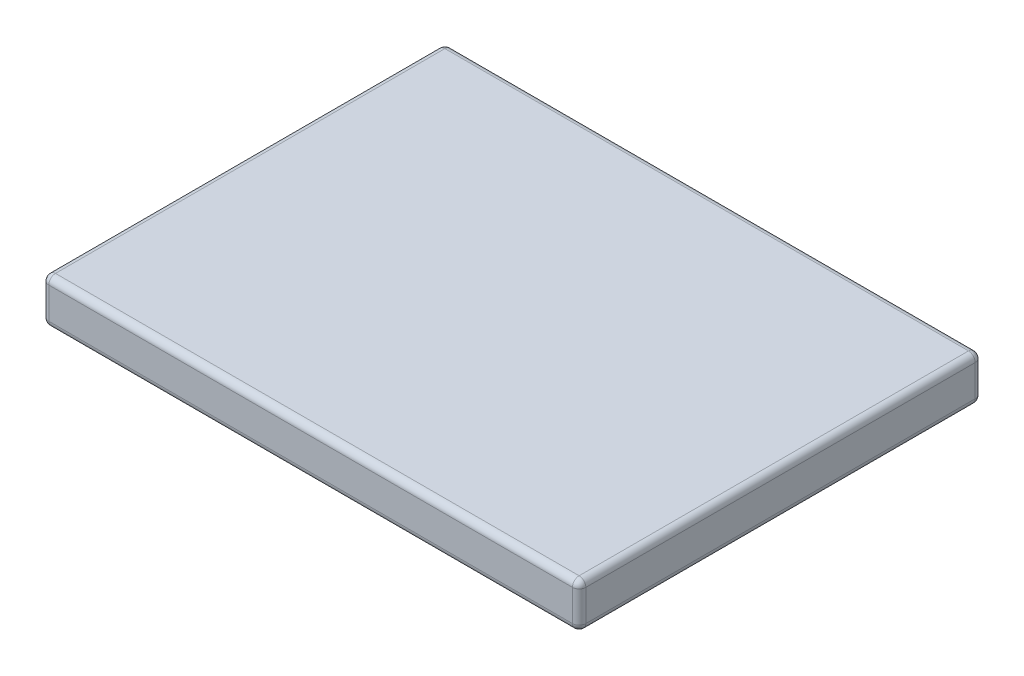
ISO-10303-21;
HEADER;
FILE_DESCRIPTION(('STEP AP214'),'2;1');
FILE_NAME('part.step','',(''),(''),'','','');
FILE_SCHEMA(('AUTOMOTIVE_DESIGN { 1 0 10303 214 1 1 1 1 }'));
ENDSEC;
DATA;
#1=APPLICATION_CONTEXT('core data for automotive mechanical design processes');
#2=APPLICATION_PROTOCOL_DEFINITION('international standard','automotive_design',2000,#1);
#3=PRODUCT_CONTEXT('',#1,'mechanical');
#4=PRODUCT('Part','Part','',(#3));
#5=PRODUCT_RELATED_PRODUCT_CATEGORY('part','',(#4));
#6=PRODUCT_DEFINITION_FORMATION('','',#4);
#7=PRODUCT_DEFINITION_CONTEXT('part definition',#1,'design');
#8=PRODUCT_DEFINITION('design','',#6,#7);
#9=PRODUCT_DEFINITION_SHAPE('','',#8);
#10=(LENGTH_UNIT() NAMED_UNIT(*) SI_UNIT(.MILLI.,.METRE.));
#11=(NAMED_UNIT(*) PLANE_ANGLE_UNIT() SI_UNIT($,.RADIAN.));
#12=(NAMED_UNIT(*) SI_UNIT($,.STERADIAN.) SOLID_ANGLE_UNIT());
#13=UNCERTAINTY_MEASURE_WITH_UNIT(LENGTH_MEASURE(1.E-05),#10,'distance_accuracy_value','');
#14=(GEOMETRIC_REPRESENTATION_CONTEXT(3) GLOBAL_UNCERTAINTY_ASSIGNED_CONTEXT((#13)) GLOBAL_UNIT_ASSIGNED_CONTEXT((#10,
#11,#12)) REPRESENTATION_CONTEXT('',''));
#15=CARTESIAN_POINT('',(0.,0.,0.));
#16=DIRECTION('',(0.,0.,1.));
#17=DIRECTION('',(1.,0.,0.));
#18=AXIS2_PLACEMENT_3D('',#15,#16,#17);
#19=CARTESIAN_POINT('',(-304.8,50.8,-228.6));
#20=DIRECTION('',(1.,0.,0.));
#21=DIRECTION('',(0.,0.,-1.));
#22=AXIS2_PLACEMENT_3D('',#19,#20,#21);
#23=PLANE('',#22);
#24=DIRECTION('',(0.,0.,1.));
#25=VECTOR('',#24,1.);
#26=CARTESIAN_POINT('',(-304.8,43.18,-228.6));
#27=LINE('',#26,#25);
#28=CARTESIAN_POINT('',(-304.8,43.18,220.98));
#29=VERTEX_POINT('',#28);
#30=CARTESIAN_POINT('',(-304.8,43.18,-220.98));
#31=VERTEX_POINT('',#30);
#32=EDGE_CURVE('E150',#29,#31,#27,.F.);
#33=ORIENTED_EDGE('',*,*,#32,.T.);
#34=DIRECTION('',(0.,-1.,0.));
#35=VECTOR('',#34,1.);
#36=CARTESIAN_POINT('',(-304.8,50.8,-220.98));
#37=LINE('',#36,#35);
#38=CARTESIAN_POINT('',(-304.8,7.62,-220.98));
#39=VERTEX_POINT('',#38);
#40=EDGE_CURVE('E153',#31,#39,#37,.T.);
#41=ORIENTED_EDGE('',*,*,#40,.T.);
#42=DIRECTION('',(0.,0.,1.));
#43=VECTOR('',#42,1.);
#44=CARTESIAN_POINT('',(-304.8,7.62,-228.6));
#45=LINE('',#44,#43);
#46=CARTESIAN_POINT('',(-304.8,7.62,220.98));
#47=VERTEX_POINT('',#46);
#48=EDGE_CURVE('E127',#39,#47,#45,.T.);
#49=ORIENTED_EDGE('',*,*,#48,.T.);
#50=DIRECTION('',(0.,-1.,0.));
#51=VECTOR('',#50,1.);
#52=CARTESIAN_POINT('',(-304.8,50.8,220.98));
#53=LINE('',#52,#51);
#54=EDGE_CURVE('E145',#47,#29,#53,.F.);
#55=ORIENTED_EDGE('',*,*,#54,.T.);
#56=EDGE_LOOP('',(#33,#41,#49,#55));
#57=FACE_BOUND('',#56,.T.);
#58=ADVANCED_FACE('F30',(#57),#23,.F.);
#59=CARTESIAN_POINT('',(-304.8,50.8,228.6));
#60=DIRECTION('',(0.,0.,-1.));
#61=DIRECTION('',(-1.,0.,0.));
#62=AXIS2_PLACEMENT_3D('',#59,#60,#61);
#63=PLANE('',#62);
#64=DIRECTION('',(1.,0.,0.));
#65=VECTOR('',#64,1.);
#66=CARTESIAN_POINT('',(-304.8,7.62,228.6));
#67=LINE('',#66,#65);
#68=CARTESIAN_POINT('',(-297.18,7.62,228.6));
#69=VERTEX_POINT('',#68);
#70=CARTESIAN_POINT('',(297.18,7.62,228.6));
#71=VERTEX_POINT('',#70);
#72=EDGE_CURVE('E170',#69,#71,#67,.T.);
#73=ORIENTED_EDGE('',*,*,#72,.T.);
#74=DIRECTION('',(0.,-1.,0.));
#75=VECTOR('',#74,1.);
#76=CARTESIAN_POINT('',(297.18,50.8,228.6));
#77=LINE('',#76,#75);
#78=CARTESIAN_POINT('',(297.18,43.18,228.6));
#79=VERTEX_POINT('',#78);
#80=EDGE_CURVE('E173',#71,#79,#77,.F.);
#81=ORIENTED_EDGE('',*,*,#80,.T.);
#82=DIRECTION('',(1.,0.,0.));
#83=VECTOR('',#82,1.);
#84=CARTESIAN_POINT('',(-304.8,43.18,228.6));
#85=LINE('',#84,#83);
#86=CARTESIAN_POINT('',(-297.18,43.18,228.6));
#87=VERTEX_POINT('',#86);
#88=EDGE_CURVE('E168',#79,#87,#85,.F.);
#89=ORIENTED_EDGE('',*,*,#88,.T.);
#90=DIRECTION('',(0.,-1.,0.));
#91=VECTOR('',#90,1.);
#92=CARTESIAN_POINT('',(-297.18,50.8,228.6));
#93=LINE('',#92,#91);
#94=EDGE_CURVE('E166',#87,#69,#93,.T.);
#95=ORIENTED_EDGE('',*,*,#94,.T.);
#96=EDGE_LOOP('',(#73,#81,#89,#95));
#97=FACE_BOUND('',#96,.T.);
#98=ADVANCED_FACE('F320',(#97),#63,.F.);
#99=CARTESIAN_POINT('',(304.8,50.8,-228.6));
#100=DIRECTION('',(-1.,0.,0.));
#101=DIRECTION('',(0.,0.,1.));
#102=AXIS2_PLACEMENT_3D('',#99,#100,#101);
#103=PLANE('',#102);
#104=DIRECTION('',(0.,0.,-1.));
#105=VECTOR('',#104,1.);
#106=CARTESIAN_POINT('',(304.8,7.62,-228.6));
#107=LINE('',#106,#105);
#108=CARTESIAN_POINT('',(304.8,7.62,220.98));
#109=VERTEX_POINT('',#108);
#110=CARTESIAN_POINT('',(304.8,7.62,-220.98));
#111=VERTEX_POINT('',#110);
#112=EDGE_CURVE('E179',#109,#111,#107,.T.);
#113=ORIENTED_EDGE('',*,*,#112,.T.);
#114=DIRECTION('',(0.,-1.,0.));
#115=VECTOR('',#114,1.);
#116=CARTESIAN_POINT('',(304.8,50.8,-220.98));
#117=LINE('',#116,#115);
#118=CARTESIAN_POINT('',(304.8,43.18,-220.98));
#119=VERTEX_POINT('',#118);
#120=EDGE_CURVE('E182',#111,#119,#117,.F.);
#121=ORIENTED_EDGE('',*,*,#120,.T.);
#122=DIRECTION('',(0.,0.,-1.));
#123=VECTOR('',#122,1.);
#124=CARTESIAN_POINT('',(304.8,43.18,228.6));
#125=LINE('',#124,#123);
#126=CARTESIAN_POINT('',(304.8,43.18,220.98));
#127=VERTEX_POINT('',#126);
#128=EDGE_CURVE('E177',#119,#127,#125,.F.);
#129=ORIENTED_EDGE('',*,*,#128,.T.);
#130=DIRECTION('',(0.,-1.,0.));
#131=VECTOR('',#130,1.);
#132=CARTESIAN_POINT('',(304.8,50.8,220.98));
#133=LINE('',#132,#131);
#134=EDGE_CURVE('E175',#127,#109,#133,.T.);
#135=ORIENTED_EDGE('',*,*,#134,.T.);
#136=EDGE_LOOP('',(#113,#121,#129,#135));
#137=FACE_BOUND('',#136,.T.);
#138=ADVANCED_FACE('F290',(#137),#103,.F.);
#139=CARTESIAN_POINT('',(-304.8,50.8,-228.6));
#140=DIRECTION('',(0.,0.,1.));
#141=DIRECTION('',(1.,0.,0.));
#142=AXIS2_PLACEMENT_3D('',#139,#140,#141);
#143=PLANE('',#142);
#144=DIRECTION('',(-1.,0.,0.));
#145=VECTOR('',#144,1.);
#146=CARTESIAN_POINT('',(-304.8,7.62,-228.6));
#147=LINE('',#146,#145);
#148=CARTESIAN_POINT('',(297.18,7.62,-228.6));
#149=VERTEX_POINT('',#148);
#150=CARTESIAN_POINT('',(-297.18,7.62,-228.6));
#151=VERTEX_POINT('',#150);
#152=EDGE_CURVE('E188',#149,#151,#147,.T.);
#153=ORIENTED_EDGE('',*,*,#152,.T.);
#154=DIRECTION('',(0.,-1.,0.));
#155=VECTOR('',#154,1.);
#156=CARTESIAN_POINT('',(-297.18,50.8,-228.6));
#157=LINE('',#156,#155);
#158=CARTESIAN_POINT('',(-297.18,43.18,-228.6));
#159=VERTEX_POINT('',#158);
#160=EDGE_CURVE('E191',#151,#159,#157,.F.);
#161=ORIENTED_EDGE('',*,*,#160,.T.);
#162=DIRECTION('',(-1.,0.,0.));
#163=VECTOR('',#162,1.);
#164=CARTESIAN_POINT('',(304.8,43.18,-228.6));
#165=LINE('',#164,#163);
#166=CARTESIAN_POINT('',(297.18,43.18,-228.6));
#167=VERTEX_POINT('',#166);
#168=EDGE_CURVE('E186',#159,#167,#165,.F.);
#169=ORIENTED_EDGE('',*,*,#168,.T.);
#170=DIRECTION('',(0.,-1.,0.));
#171=VECTOR('',#170,1.);
#172=CARTESIAN_POINT('',(297.18,50.8,-228.6));
#173=LINE('',#172,#171);
#174=EDGE_CURVE('E184',#167,#149,#173,.T.);
#175=ORIENTED_EDGE('',*,*,#174,.T.);
#176=EDGE_LOOP('',(#153,#161,#169,#175));
#177=FACE_BOUND('',#176,.T.);
#178=ADVANCED_FACE('F266',(#177),#143,.F.);
#179=CARTESIAN_POINT('',(-304.8,50.8,228.6));
#180=DIRECTION('',(0.,1.,0.));
#181=DIRECTION('',(0.,0.,1.));
#182=AXIS2_PLACEMENT_3D('',#179,#180,#181);
#183=PLANE('',#182);
#184=DIRECTION('',(-1.,0.,0.));
#185=VECTOR('',#184,1.);
#186=CARTESIAN_POINT('',(-304.8,50.8,-220.98));
#187=LINE('',#186,#185);
#188=CARTESIAN_POINT('',(297.18,50.8,-220.98));
#189=VERTEX_POINT('',#188);
#190=CARTESIAN_POINT('',(-297.18,50.8,-220.98));
#191=VERTEX_POINT('',#190);
#192=EDGE_CURVE('E193',#189,#191,#187,.T.);
#193=ORIENTED_EDGE('',*,*,#192,.T.);
#194=DIRECTION('',(0.,0.,1.));
#195=VECTOR('',#194,1.);
#196=CARTESIAN_POINT('',(-297.18,50.8,228.6));
#197=LINE('',#196,#195);
#198=CARTESIAN_POINT('',(-297.18,50.8,220.98));
#199=VERTEX_POINT('',#198);
#200=EDGE_CURVE('E11',#191,#199,#197,.T.);
#201=ORIENTED_EDGE('',*,*,#200,.T.);
#202=DIRECTION('',(1.,0.,0.));
#203=VECTOR('',#202,1.);
#204=CARTESIAN_POINT('',(304.8,50.8,220.98));
#205=LINE('',#204,#203);
#206=CARTESIAN_POINT('',(297.18,50.8,220.98));
#207=VERTEX_POINT('',#206);
#208=EDGE_CURVE('E39',#199,#207,#205,.T.);
#209=ORIENTED_EDGE('',*,*,#208,.T.);
#210=DIRECTION('',(0.,0.,-1.));
#211=VECTOR('',#210,1.);
#212=CARTESIAN_POINT('',(297.18,50.8,-228.6));
#213=LINE('',#212,#211);
#214=EDGE_CURVE('E195',#207,#189,#213,.T.);
#215=ORIENTED_EDGE('',*,*,#214,.T.);
#216=EDGE_LOOP('',(#193,#201,#209,#215));
#217=FACE_BOUND('',#216,.T.);
#218=ADVANCED_FACE('F274',(#217),#183,.T.);
#219=CARTESIAN_POINT('',(-304.8,0.,228.6));
#220=DIRECTION('',(0.,1.,0.));
#221=DIRECTION('',(0.,0.,1.));
#222=AXIS2_PLACEMENT_3D('',#219,#220,#221);
#223=PLANE('',#222);
#224=DIRECTION('',(1.,0.,0.));
#225=VECTOR('',#224,1.);
#226=CARTESIAN_POINT('',(-304.8,0.,220.98));
#227=LINE('',#226,#225);
#228=CARTESIAN_POINT('',(297.18,0.,220.98));
#229=VERTEX_POINT('',#228);
#230=CARTESIAN_POINT('',(-297.18,0.,220.98));
#231=VERTEX_POINT('',#230);
#232=EDGE_CURVE('E163',#229,#231,#227,.F.);
#233=ORIENTED_EDGE('',*,*,#232,.T.);
#234=DIRECTION('',(0.,0.,1.));
#235=VECTOR('',#234,1.);
#236=CARTESIAN_POINT('',(-297.18,0.,228.6));
#237=LINE('',#236,#235);
#238=CARTESIAN_POINT('',(-297.18,0.,-220.98));
#239=VERTEX_POINT('',#238);
#240=EDGE_CURVE('E129',#231,#239,#237,.F.);
#241=ORIENTED_EDGE('',*,*,#240,.T.);
#242=DIRECTION('',(-1.,0.,0.));
#243=VECTOR('',#242,1.);
#244=CARTESIAN_POINT('',(-304.8,0.,-220.98));
#245=LINE('',#244,#243);
#246=CARTESIAN_POINT('',(297.18,0.,-220.98));
#247=VERTEX_POINT('',#246);
#248=EDGE_CURVE('E156',#239,#247,#245,.F.);
#249=ORIENTED_EDGE('',*,*,#248,.T.);
#250=DIRECTION('',(0.,0.,-1.));
#251=VECTOR('',#250,1.);
#252=CARTESIAN_POINT('',(297.18,0.,228.6));
#253=LINE('',#252,#251);
#254=EDGE_CURVE('E161',#247,#229,#253,.F.);
#255=ORIENTED_EDGE('',*,*,#254,.T.);
#256=EDGE_LOOP('',(#233,#241,#249,#255));
#257=FACE_BOUND('',#256,.T.);
#258=ADVANCED_FACE('F353',(#257),#223,.F.);
#259=CARTESIAN_POINT('',(297.18,43.18,228.6));
#260=DIRECTION('',(0.,0.,1.));
#261=DIRECTION('',(1.,0.,0.));
#262=AXIS2_PLACEMENT_3D('',#259,#260,#261);
#263=CYLINDRICAL_SURFACE('',#262,7.62);
#264=CARTESIAN_POINT('',(297.18,43.18,-220.98));
#265=DIRECTION('',(0.,0.,-1.));
#266=DIRECTION('',(-1.,0.,0.));
#267=AXIS2_PLACEMENT_3D('',#264,#265,#266);
#268=CIRCLE('',#267,7.62);
#269=EDGE_CURVE('E34',#189,#119,#268,.T.);
#270=ORIENTED_EDGE('',*,*,#269,.F.);
#271=ORIENTED_EDGE('',*,*,#214,.F.);
#272=CARTESIAN_POINT('',(297.18,43.18,220.98));
#273=DIRECTION('',(0.,0.,1.));
#274=DIRECTION('',(0.,-1.,0.));
#275=AXIS2_PLACEMENT_3D('',#272,#273,#274);
#276=CIRCLE('',#275,7.62);
#277=EDGE_CURVE('E244',#127,#207,#276,.T.);
#278=ORIENTED_EDGE('',*,*,#277,.F.);
#279=ORIENTED_EDGE('',*,*,#128,.F.);
#280=EDGE_LOOP('',(#270,#271,#278,#279));
#281=FACE_BOUND('',#280,.T.);
#282=ADVANCED_FACE('F32',(#281),#263,.T.);
#283=CARTESIAN_POINT('',(297.18,43.18,-220.98));
#284=DIRECTION('',(0.,0.,1.));
#285=DIRECTION('',(1.,0.,0.));
#286=AXIS2_PLACEMENT_3D('',#283,#284,#285);
#287=SPHERICAL_SURFACE('',#286,7.62);
#288=CARTESIAN_POINT('',(297.18,43.18,-220.98));
#289=DIRECTION('',(1.,0.,0.));
#290=DIRECTION('',(0.,1.,0.));
#291=AXIS2_PLACEMENT_3D('',#288,#289,#290);
#292=CIRCLE('',#291,7.62);
#293=EDGE_CURVE('E239',#189,#167,#292,.F.);
#294=ORIENTED_EDGE('',*,*,#293,.F.);
#295=ORIENTED_EDGE('',*,*,#269,.T.);
#296=CARTESIAN_POINT('',(297.18,43.18,-220.98));
#297=DIRECTION('',(0.,1.,0.));
#298=DIRECTION('',(0.,0.,1.));
#299=AXIS2_PLACEMENT_3D('',#296,#297,#298);
#300=CIRCLE('',#299,7.62);
#301=EDGE_CURVE('E242',#167,#119,#300,.F.);
#302=ORIENTED_EDGE('',*,*,#301,.F.);
#303=EDGE_LOOP('',(#294,#295,#302));
#304=FACE_BOUND('',#303,.T.);
#305=ADVANCED_FACE('F255',(#304),#287,.T.);
#306=CARTESIAN_POINT('',(297.18,43.18,220.98));
#307=DIRECTION('',(0.,0.,1.));
#308=DIRECTION('',(1.,0.,0.));
#309=AXIS2_PLACEMENT_3D('',#306,#307,#308);
#310=SPHERICAL_SURFACE('',#309,7.62);
#311=CARTESIAN_POINT('',(297.18,43.18,220.98));
#312=DIRECTION('',(0.,1.,0.));
#313=DIRECTION('',(0.,0.,1.));
#314=AXIS2_PLACEMENT_3D('',#311,#312,#313);
#315=CIRCLE('',#314,7.62);
#316=EDGE_CURVE('E233',#127,#79,#315,.F.);
#317=ORIENTED_EDGE('',*,*,#316,.F.);
#318=ORIENTED_EDGE('',*,*,#277,.T.);
#319=CARTESIAN_POINT('',(297.18,43.18,220.98));
#320=DIRECTION('',(1.,0.,0.));
#321=DIRECTION('',(0.,0.,-1.));
#322=AXIS2_PLACEMENT_3D('',#319,#320,#321);
#323=CIRCLE('',#322,7.62);
#324=EDGE_CURVE('E236',#79,#207,#323,.F.);
#325=ORIENTED_EDGE('',*,*,#324,.F.);
#326=EDGE_LOOP('',(#317,#318,#325));
#327=FACE_BOUND('',#326,.T.);
#328=ADVANCED_FACE('F282',(#327),#310,.T.);
#329=CARTESIAN_POINT('',(297.18,50.8,-220.98));
#330=DIRECTION('',(0.,-1.,0.));
#331=DIRECTION('',(0.,0.,-1.));
#332=AXIS2_PLACEMENT_3D('',#329,#330,#331);
#333=CYLINDRICAL_SURFACE('',#332,7.62);
#334=ORIENTED_EDGE('',*,*,#301,.T.);
#335=ORIENTED_EDGE('',*,*,#120,.F.);
#336=CARTESIAN_POINT('',(297.18,7.62,-220.98));
#337=DIRECTION('',(0.,-1.,0.));
#338=DIRECTION('',(0.,0.,-1.));
#339=AXIS2_PLACEMENT_3D('',#336,#337,#338);
#340=CIRCLE('',#339,7.62);
#341=EDGE_CURVE('E228',#149,#111,#340,.T.);
#342=ORIENTED_EDGE('',*,*,#341,.F.);
#343=ORIENTED_EDGE('',*,*,#174,.F.);
#344=EDGE_LOOP('',(#334,#335,#342,#343));
#345=FACE_BOUND('',#344,.T.);
#346=ADVANCED_FACE('F262',(#345),#333,.T.);
#347=CARTESIAN_POINT('',(-304.8,43.18,-220.98));
#348=DIRECTION('',(1.,0.,0.));
#349=DIRECTION('',(0.,0.,-1.));
#350=AXIS2_PLACEMENT_3D('',#347,#348,#349);
#351=CYLINDRICAL_SURFACE('',#350,7.62);
#352=ORIENTED_EDGE('',*,*,#293,.T.);
#353=ORIENTED_EDGE('',*,*,#168,.F.);
#354=CARTESIAN_POINT('',(-297.18,43.18,-220.98));
#355=DIRECTION('',(-1.,0.,0.));
#356=DIRECTION('',(0.,0.,1.));
#357=AXIS2_PLACEMENT_3D('',#354,#355,#356);
#358=CIRCLE('',#357,7.62);
#359=EDGE_CURVE('E225',#191,#159,#358,.T.);
#360=ORIENTED_EDGE('',*,*,#359,.F.);
#361=ORIENTED_EDGE('',*,*,#192,.F.);
#362=EDGE_LOOP('',(#352,#353,#360,#361));
#363=FACE_BOUND('',#362,.T.);
#364=ADVANCED_FACE('F272',(#363),#351,.T.);
#365=CARTESIAN_POINT('',(-297.18,43.18,228.6));
#366=DIRECTION('',(0.,0.,-1.));
#367=DIRECTION('',(-1.,0.,0.));
#368=AXIS2_PLACEMENT_3D('',#365,#366,#367);
#369=CYLINDRICAL_SURFACE('',#368,7.62);
#370=CARTESIAN_POINT('',(-297.18,43.18,220.98));
#371=DIRECTION('',(0.,0.,1.));
#372=DIRECTION('',(1.,0.,0.));
#373=AXIS2_PLACEMENT_3D('',#370,#371,#372);
#374=CIRCLE('',#373,7.62);
#375=EDGE_CURVE('E220',#199,#29,#374,.T.);
#376=ORIENTED_EDGE('',*,*,#375,.F.);
#377=ORIENTED_EDGE('',*,*,#200,.F.);
#378=CARTESIAN_POINT('',(-297.18,43.18,-220.98));
#379=DIRECTION('',(0.,0.,-1.));
#380=DIRECTION('',(0.,1.,0.));
#381=AXIS2_PLACEMENT_3D('',#378,#379,#380);
#382=CIRCLE('',#381,7.62);
#383=EDGE_CURVE('E222',#31,#191,#382,.T.);
#384=ORIENTED_EDGE('',*,*,#383,.F.);
#385=ORIENTED_EDGE('',*,*,#32,.F.);
#386=EDGE_LOOP('',(#376,#377,#384,#385));
#387=FACE_BOUND('',#386,.T.);
#388=ADVANCED_FACE('F277',(#387),#369,.T.);
#389=CARTESIAN_POINT('',(-304.8,43.18,220.98));
#390=DIRECTION('',(-1.,0.,0.));
#391=DIRECTION('',(0.,0.,1.));
#392=AXIS2_PLACEMENT_3D('',#389,#390,#391);
#393=CYLINDRICAL_SURFACE('',#392,7.62);
#394=ORIENTED_EDGE('',*,*,#324,.T.);
#395=ORIENTED_EDGE('',*,*,#208,.F.);
#396=CARTESIAN_POINT('',(-297.18,43.18,220.98));
#397=DIRECTION('',(-1.,0.,0.));
#398=DIRECTION('',(0.,0.,1.));
#399=AXIS2_PLACEMENT_3D('',#396,#397,#398);
#400=CIRCLE('',#399,7.62);
#401=EDGE_CURVE('E47',#87,#199,#400,.T.);
#402=ORIENTED_EDGE('',*,*,#401,.F.);
#403=ORIENTED_EDGE('',*,*,#88,.F.);
#404=EDGE_LOOP('',(#394,#395,#402,#403));
#405=FACE_BOUND('',#404,.T.);
#406=ADVANCED_FACE('F280',(#405),#393,.T.);
#407=CARTESIAN_POINT('',(297.18,50.8,220.98));
#408=DIRECTION('',(0.,-1.,0.));
#409=DIRECTION('',(0.,0.,-1.));
#410=AXIS2_PLACEMENT_3D('',#407,#408,#409);
#411=CYLINDRICAL_SURFACE('',#410,7.62);
#412=ORIENTED_EDGE('',*,*,#316,.T.);
#413=ORIENTED_EDGE('',*,*,#80,.F.);
#414=CARTESIAN_POINT('',(297.18,7.62,220.98));
#415=DIRECTION('',(0.,-1.,0.));
#416=DIRECTION('',(0.,0.,-1.));
#417=AXIS2_PLACEMENT_3D('',#414,#415,#416);
#418=CIRCLE('',#417,7.62);
#419=EDGE_CURVE('E216',#109,#71,#418,.T.);
#420=ORIENTED_EDGE('',*,*,#419,.F.);
#421=ORIENTED_EDGE('',*,*,#134,.F.);
#422=EDGE_LOOP('',(#412,#413,#420,#421));
#423=FACE_BOUND('',#422,.T.);
#424=ADVANCED_FACE('F287',(#423),#411,.T.);
#425=CARTESIAN_POINT('',(297.18,7.62,-228.6));
#426=DIRECTION('',(0.,0.,-1.));
#427=DIRECTION('',(-1.,0.,0.));
#428=AXIS2_PLACEMENT_3D('',#425,#426,#427);
#429=CYLINDRICAL_SURFACE('',#428,7.62);
#430=CARTESIAN_POINT('',(297.18,7.62,-220.98));
#431=DIRECTION('',(0.,0.,-1.));
#432=DIRECTION('',(-1.,0.,0.));
#433=AXIS2_PLACEMENT_3D('',#430,#431,#432);
#434=CIRCLE('',#433,7.62);
#435=EDGE_CURVE('E230',#111,#247,#434,.T.);
#436=ORIENTED_EDGE('',*,*,#435,.F.);
#437=ORIENTED_EDGE('',*,*,#112,.F.);
#438=CARTESIAN_POINT('',(297.18,7.62,220.98));
#439=DIRECTION('',(0.,0.,1.));
#440=DIRECTION('',(1.,0.,0.));
#441=AXIS2_PLACEMENT_3D('',#438,#439,#440);
#442=CIRCLE('',#441,7.62);
#443=EDGE_CURVE('E213',#229,#109,#442,.T.);
#444=ORIENTED_EDGE('',*,*,#443,.F.);
#445=ORIENTED_EDGE('',*,*,#254,.F.);
#446=EDGE_LOOP('',(#436,#437,#444,#445));
#447=FACE_BOUND('',#446,.T.);
#448=ADVANCED_FACE('F294',(#447),#429,.T.);
#449=CARTESIAN_POINT('',(297.18,7.62,-220.98));
#450=DIRECTION('',(0.,0.,1.));
#451=DIRECTION('',(1.,0.,0.));
#452=AXIS2_PLACEMENT_3D('',#449,#450,#451);
#453=SPHERICAL_SURFACE('',#452,7.62);
#454=ORIENTED_EDGE('',*,*,#341,.T.);
#455=ORIENTED_EDGE('',*,*,#435,.T.);
#456=CARTESIAN_POINT('',(297.18,7.62,-220.98));
#457=DIRECTION('',(1.,0.,0.));
#458=DIRECTION('',(0.,0.,-1.));
#459=AXIS2_PLACEMENT_3D('',#456,#457,#458);
#460=CIRCLE('',#459,7.62);
#461=EDGE_CURVE('E210',#149,#247,#460,.F.);
#462=ORIENTED_EDGE('',*,*,#461,.F.);
#463=EDGE_LOOP('',(#454,#455,#462));
#464=FACE_BOUND('',#463,.T.);
#465=ADVANCED_FACE('F298',(#464),#453,.T.);
#466=CARTESIAN_POINT('',(-297.18,43.18,-220.98));
#467=DIRECTION('',(0.,0.,1.));
#468=DIRECTION('',(1.,0.,0.));
#469=AXIS2_PLACEMENT_3D('',#466,#467,#468);
#470=SPHERICAL_SURFACE('',#469,7.62);
#471=ORIENTED_EDGE('',*,*,#383,.T.);
#472=ORIENTED_EDGE('',*,*,#359,.T.);
#473=CARTESIAN_POINT('',(-297.18,43.18,-220.98));
#474=DIRECTION('',(0.,1.,0.));
#475=DIRECTION('',(0.,0.,1.));
#476=AXIS2_PLACEMENT_3D('',#473,#474,#475);
#477=CIRCLE('',#476,7.62);
#478=EDGE_CURVE('E207',#31,#159,#477,.F.);
#479=ORIENTED_EDGE('',*,*,#478,.F.);
#480=EDGE_LOOP('',(#471,#472,#479));
#481=FACE_BOUND('',#480,.T.);
#482=ADVANCED_FACE('F308',(#481),#470,.T.);
#483=CARTESIAN_POINT('',(-297.18,43.18,220.98));
#484=DIRECTION('',(0.,0.,1.));
#485=DIRECTION('',(1.,0.,0.));
#486=AXIS2_PLACEMENT_3D('',#483,#484,#485);
#487=SPHERICAL_SURFACE('',#486,7.62);
#488=ORIENTED_EDGE('',*,*,#401,.T.);
#489=ORIENTED_EDGE('',*,*,#375,.T.);
#490=CARTESIAN_POINT('',(-297.18,43.18,220.98));
#491=DIRECTION('',(0.,1.,0.));
#492=DIRECTION('',(0.,0.,1.));
#493=AXIS2_PLACEMENT_3D('',#490,#491,#492);
#494=CIRCLE('',#493,7.62);
#495=EDGE_CURVE('E147',#87,#29,#494,.F.);
#496=ORIENTED_EDGE('',*,*,#495,.F.);
#497=EDGE_LOOP('',(#488,#489,#496));
#498=FACE_BOUND('',#497,.T.);
#499=ADVANCED_FACE('F310',(#498),#487,.T.);
#500=CARTESIAN_POINT('',(297.18,7.62,220.98));
#501=DIRECTION('',(0.,0.,1.));
#502=DIRECTION('',(1.,0.,0.));
#503=AXIS2_PLACEMENT_3D('',#500,#501,#502);
#504=SPHERICAL_SURFACE('',#503,7.62);
#505=ORIENTED_EDGE('',*,*,#443,.T.);
#506=ORIENTED_EDGE('',*,*,#419,.T.);
#507=CARTESIAN_POINT('',(297.18,7.62,220.98));
#508=DIRECTION('',(1.,0.,0.));
#509=DIRECTION('',(0.,0.,-1.));
#510=AXIS2_PLACEMENT_3D('',#507,#508,#509);
#511=CIRCLE('',#510,7.62);
#512=EDGE_CURVE('E204',#229,#71,#511,.F.);
#513=ORIENTED_EDGE('',*,*,#512,.F.);
#514=EDGE_LOOP('',(#505,#506,#513));
#515=FACE_BOUND('',#514,.T.);
#516=ADVANCED_FACE('F316',(#515),#504,.T.);
#517=CARTESIAN_POINT('',(-304.8,7.62,-220.98));
#518=DIRECTION('',(-1.,0.,0.));
#519=DIRECTION('',(0.,0.,1.));
#520=AXIS2_PLACEMENT_3D('',#517,#518,#519);
#521=CYLINDRICAL_SURFACE('',#520,7.62);
#522=ORIENTED_EDGE('',*,*,#461,.T.);
#523=ORIENTED_EDGE('',*,*,#248,.F.);
#524=CARTESIAN_POINT('',(-297.18,7.62,-220.98));
#525=DIRECTION('',(-1.,0.,0.));
#526=DIRECTION('',(0.,0.,1.));
#527=AXIS2_PLACEMENT_3D('',#524,#525,#526);
#528=CIRCLE('',#527,7.62);
#529=EDGE_CURVE('E201',#151,#239,#528,.T.);
#530=ORIENTED_EDGE('',*,*,#529,.F.);
#531=ORIENTED_EDGE('',*,*,#152,.F.);
#532=EDGE_LOOP('',(#522,#523,#530,#531));
#533=FACE_BOUND('',#532,.T.);
#534=ADVANCED_FACE('F301',(#533),#521,.T.);
#535=CARTESIAN_POINT('',(-297.18,50.8,-220.98));
#536=DIRECTION('',(0.,-1.,0.));
#537=DIRECTION('',(0.,0.,-1.));
#538=AXIS2_PLACEMENT_3D('',#535,#536,#537);
#539=CYLINDRICAL_SURFACE('',#538,7.62);
#540=ORIENTED_EDGE('',*,*,#478,.T.);
#541=ORIENTED_EDGE('',*,*,#160,.F.);
#542=CARTESIAN_POINT('',(-297.18,7.62,-220.98));
#543=DIRECTION('',(0.,-1.,0.));
#544=DIRECTION('',(0.,0.,-1.));
#545=AXIS2_PLACEMENT_3D('',#542,#543,#544);
#546=CIRCLE('',#545,7.62);
#547=EDGE_CURVE('E142',#39,#151,#546,.T.);
#548=ORIENTED_EDGE('',*,*,#547,.F.);
#549=ORIENTED_EDGE('',*,*,#40,.F.);
#550=EDGE_LOOP('',(#540,#541,#548,#549));
#551=FACE_BOUND('',#550,.T.);
#552=ADVANCED_FACE('F306',(#551),#539,.T.);
#553=CARTESIAN_POINT('',(-297.18,50.8,220.98));
#554=DIRECTION('',(0.,-1.,0.));
#555=DIRECTION('',(0.,0.,-1.));
#556=AXIS2_PLACEMENT_3D('',#553,#554,#555);
#557=CYLINDRICAL_SURFACE('',#556,7.62);
#558=ORIENTED_EDGE('',*,*,#495,.T.);
#559=ORIENTED_EDGE('',*,*,#54,.F.);
#560=CARTESIAN_POINT('',(-297.18,7.62,220.98));
#561=DIRECTION('',(0.,-1.,0.));
#562=DIRECTION('',(0.,0.,-1.));
#563=AXIS2_PLACEMENT_3D('',#560,#561,#562);
#564=CIRCLE('',#563,7.62);
#565=EDGE_CURVE('E135',#69,#47,#564,.T.);
#566=ORIENTED_EDGE('',*,*,#565,.F.);
#567=ORIENTED_EDGE('',*,*,#94,.F.);
#568=EDGE_LOOP('',(#558,#559,#566,#567));
#569=FACE_BOUND('',#568,.T.);
#570=ADVANCED_FACE('F146',(#569),#557,.T.);
#571=CARTESIAN_POINT('',(-304.8,7.62,220.98));
#572=DIRECTION('',(1.,0.,0.));
#573=DIRECTION('',(0.,0.,-1.));
#574=AXIS2_PLACEMENT_3D('',#571,#572,#573);
#575=CYLINDRICAL_SURFACE('',#574,7.62);
#576=ORIENTED_EDGE('',*,*,#512,.T.);
#577=ORIENTED_EDGE('',*,*,#72,.F.);
#578=CARTESIAN_POINT('',(-297.18,7.62,220.98));
#579=DIRECTION('',(-1.,0.,0.));
#580=DIRECTION('',(0.,0.,1.));
#581=AXIS2_PLACEMENT_3D('',#578,#579,#580);
#582=CIRCLE('',#581,7.62);
#583=EDGE_CURVE('E139',#231,#69,#582,.T.);
#584=ORIENTED_EDGE('',*,*,#583,.F.);
#585=ORIENTED_EDGE('',*,*,#232,.F.);
#586=EDGE_LOOP('',(#576,#577,#584,#585));
#587=FACE_BOUND('',#586,.T.);
#588=ADVANCED_FACE('F336',(#587),#575,.T.);
#589=CARTESIAN_POINT('',(-297.18,7.62,-220.98));
#590=DIRECTION('',(0.,0.,1.));
#591=DIRECTION('',(1.,0.,0.));
#592=AXIS2_PLACEMENT_3D('',#589,#590,#591);
#593=SPHERICAL_SURFACE('',#592,7.62);
#594=ORIENTED_EDGE('',*,*,#547,.T.);
#595=ORIENTED_EDGE('',*,*,#529,.T.);
#596=CARTESIAN_POINT('',(-297.18,7.62,-220.98));
#597=DIRECTION('',(0.,0.,-1.));
#598=DIRECTION('',(-1.,0.,0.));
#599=AXIS2_PLACEMENT_3D('',#596,#597,#598);
#600=CIRCLE('',#599,7.62);
#601=EDGE_CURVE('E132',#39,#239,#600,.F.);
#602=ORIENTED_EDGE('',*,*,#601,.F.);
#603=EDGE_LOOP('',(#594,#595,#602));
#604=FACE_BOUND('',#603,.T.);
#605=ADVANCED_FACE('F333',(#604),#593,.T.);
#606=CARTESIAN_POINT('',(-297.18,7.62,220.98));
#607=DIRECTION('',(0.,0.,1.));
#608=DIRECTION('',(1.,0.,0.));
#609=AXIS2_PLACEMENT_3D('',#606,#607,#608);
#610=SPHERICAL_SURFACE('',#609,7.62);
#611=ORIENTED_EDGE('',*,*,#583,.T.);
#612=ORIENTED_EDGE('',*,*,#565,.T.);
#613=CARTESIAN_POINT('',(-297.18,7.62,220.98));
#614=DIRECTION('',(0.,0.,1.));
#615=DIRECTION('',(1.,0.,0.));
#616=AXIS2_PLACEMENT_3D('',#613,#614,#615);
#617=CIRCLE('',#616,7.62);
#618=EDGE_CURVE('E123',#231,#47,#617,.F.);
#619=ORIENTED_EDGE('',*,*,#618,.F.);
#620=EDGE_LOOP('',(#611,#612,#619));
#621=FACE_BOUND('',#620,.T.);
#622=ADVANCED_FACE('F137',(#621),#610,.T.);
#623=CARTESIAN_POINT('',(-297.18,7.62,-228.6));
#624=DIRECTION('',(0.,0.,1.));
#625=DIRECTION('',(1.,0.,0.));
#626=AXIS2_PLACEMENT_3D('',#623,#624,#625);
#627=CYLINDRICAL_SURFACE('',#626,7.62);
#628=ORIENTED_EDGE('',*,*,#601,.T.);
#629=ORIENTED_EDGE('',*,*,#240,.F.);
#630=ORIENTED_EDGE('',*,*,#618,.T.);
#631=ORIENTED_EDGE('',*,*,#48,.F.);
#632=EDGE_LOOP('',(#628,#629,#630,#631));
#633=FACE_BOUND('',#632,.T.);
#634=ADVANCED_FACE('F125',(#633),#627,.T.);
#635=CLOSED_SHELL('',(#58,#98,#138,#178,#218,#258,#282,#305,#328,#346,#364,#388,#406,#424,#448,
#465,#482,#499,#516,#534,#552,#570,#588,#605,#622,#634));
#636=MANIFOLD_SOLID_BREP('B2',#635);
#637=ADVANCED_BREP_SHAPE_REPRESENTATION('',(#18,#636),#14);
#638=SHAPE_DEFINITION_REPRESENTATION(#9,#637);
ENDSEC;
END-ISO-10303-21;
